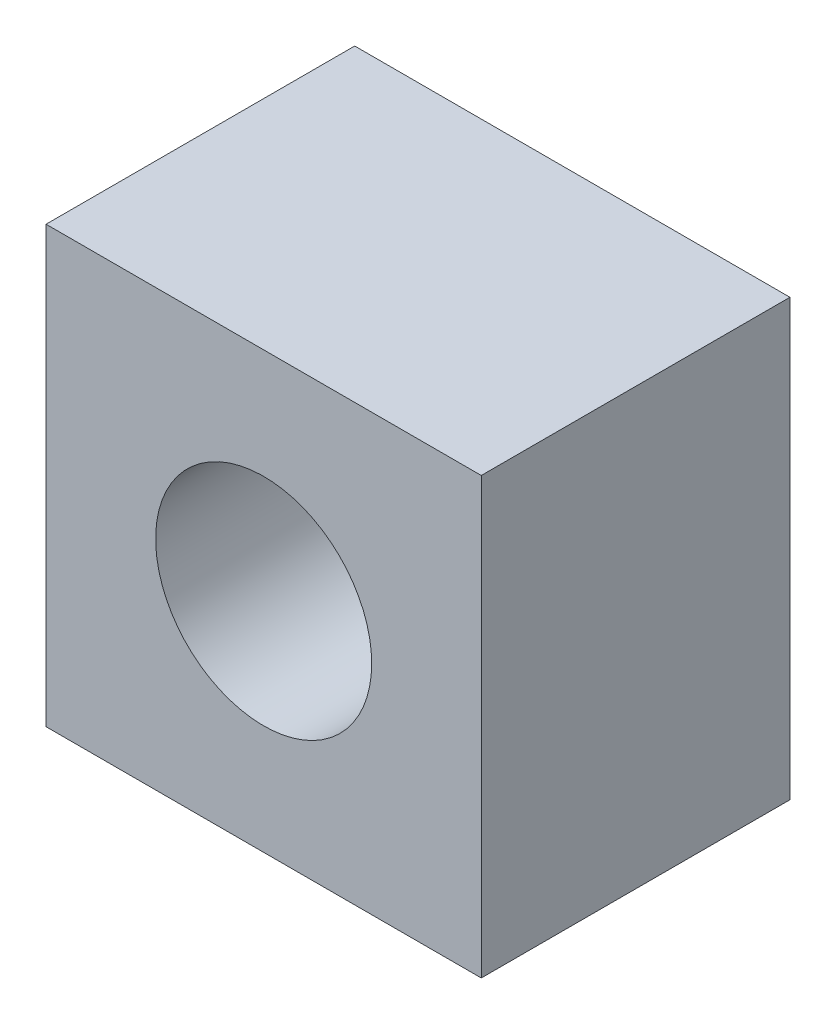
ISO-10303-21;
HEADER;
FILE_DESCRIPTION(('STEP AP214'),'2;1');
FILE_NAME('part.step','',(''),(''),'','','');
FILE_SCHEMA(('AUTOMOTIVE_DESIGN { 1 0 10303 214 1 1 1 1 }'));
ENDSEC;
DATA;
#1=APPLICATION_CONTEXT('core data for automotive mechanical design processes');
#2=APPLICATION_PROTOCOL_DEFINITION('international standard','automotive_design',2000,#1);
#3=PRODUCT_CONTEXT('',#1,'mechanical');
#4=PRODUCT('Part','Part','',(#3));
#5=PRODUCT_RELATED_PRODUCT_CATEGORY('part','',(#4));
#6=PRODUCT_DEFINITION_FORMATION('','',#4);
#7=PRODUCT_DEFINITION_CONTEXT('part definition',#1,'design');
#8=PRODUCT_DEFINITION('design','',#6,#7);
#9=PRODUCT_DEFINITION_SHAPE('','',#8);
#10=(LENGTH_UNIT() NAMED_UNIT(*) SI_UNIT(.MILLI.,.METRE.));
#11=(NAMED_UNIT(*) PLANE_ANGLE_UNIT() SI_UNIT($,.RADIAN.));
#12=(NAMED_UNIT(*) SI_UNIT($,.STERADIAN.) SOLID_ANGLE_UNIT());
#13=UNCERTAINTY_MEASURE_WITH_UNIT(LENGTH_MEASURE(1.E-05),#10,'distance_accuracy_value','');
#14=(GEOMETRIC_REPRESENTATION_CONTEXT(3) GLOBAL_UNCERTAINTY_ASSIGNED_CONTEXT((#13)) GLOBAL_UNIT_ASSIGNED_CONTEXT((#10,
#11,#12)) REPRESENTATION_CONTEXT('',''));
#15=CARTESIAN_POINT('',(0.,0.,0.));
#16=DIRECTION('',(0.,0.,1.));
#17=DIRECTION('',(1.,0.,0.));
#18=AXIS2_PLACEMENT_3D('',#15,#16,#17);
#19=CARTESIAN_POINT('',(-7.05,-7.05,10.));
#20=DIRECTION('',(0.,0.,1.));
#21=DIRECTION('',(1.,0.,0.));
#22=AXIS2_PLACEMENT_3D('',#19,#20,#21);
#23=PLANE('',#22);
#24=DIRECTION('',(0.,-1.,0.));
#25=VECTOR('',#24,1.);
#26=CARTESIAN_POINT('',(-7.05,7.05,10.));
#27=LINE('',#26,#25);
#28=CARTESIAN_POINT('',(-7.05,7.05,10.));
#29=VERTEX_POINT('',#28);
#30=CARTESIAN_POINT('',(-7.05,-7.05,10.));
#31=VERTEX_POINT('',#30);
#32=EDGE_CURVE('E99',#29,#31,#27,.T.);
#33=ORIENTED_EDGE('',*,*,#32,.T.);
#34=DIRECTION('',(1.,0.,0.));
#35=VECTOR('',#34,1.);
#36=CARTESIAN_POINT('',(-7.05,-7.05,10.));
#37=LINE('',#36,#35);
#38=CARTESIAN_POINT('',(7.05,-7.05,10.));
#39=VERTEX_POINT('',#38);
#40=EDGE_CURVE('E84',#31,#39,#37,.T.);
#41=ORIENTED_EDGE('',*,*,#40,.T.);
#42=DIRECTION('',(0.,1.,0.));
#43=VECTOR('',#42,1.);
#44=CARTESIAN_POINT('',(7.05,7.05,10.));
#45=LINE('',#44,#43);
#46=CARTESIAN_POINT('',(7.05,7.05,10.));
#47=VERTEX_POINT('',#46);
#48=EDGE_CURVE('E50',#39,#47,#45,.T.);
#49=ORIENTED_EDGE('',*,*,#48,.T.);
#50=DIRECTION('',(-1.,0.,0.));
#51=VECTOR('',#50,1.);
#52=CARTESIAN_POINT('',(-7.05,7.05,10.));
#53=LINE('',#52,#51);
#54=EDGE_CURVE('E45',#47,#29,#53,.T.);
#55=ORIENTED_EDGE('',*,*,#54,.T.);
#56=EDGE_LOOP('',(#33,#41,#49,#55));
#57=FACE_BOUND('',#56,.T.);
#58=CARTESIAN_POINT('',(0.,0.,10.));
#59=DIRECTION('',(0.,0.,1.));
#60=DIRECTION('',(1.,0.,0.));
#61=AXIS2_PLACEMENT_3D('',#58,#59,#60);
#62=CIRCLE('',#61,3.5);
#63=CARTESIAN_POINT('',(3.5,0.,10.));
#64=VERTEX_POINT('',#63);
#65=EDGE_CURVE('E89',#64,#64,#62,.T.);
#66=ORIENTED_EDGE('',*,*,#65,.F.);
#67=EDGE_LOOP('',(#66));
#68=FACE_BOUND('',#67,.T.);
#69=ADVANCED_FACE('F30',(#57,#68),#23,.T.);
#70=CARTESIAN_POINT('',(-7.05,-7.05,0.));
#71=DIRECTION('',(0.,0.,1.));
#72=DIRECTION('',(1.,0.,0.));
#73=AXIS2_PLACEMENT_3D('',#70,#71,#72);
#74=PLANE('',#73);
#75=DIRECTION('',(0.,-1.,0.));
#76=VECTOR('',#75,1.);
#77=CARTESIAN_POINT('',(-7.05,7.05,0.));
#78=LINE('',#77,#76);
#79=CARTESIAN_POINT('',(-7.05,7.05,0.));
#80=VERTEX_POINT('',#79);
#81=CARTESIAN_POINT('',(-7.05,-7.05,0.));
#82=VERTEX_POINT('',#81);
#83=EDGE_CURVE('E76',#80,#82,#78,.T.);
#84=ORIENTED_EDGE('',*,*,#83,.F.);
#85=DIRECTION('',(-1.,0.,0.));
#86=VECTOR('',#85,1.);
#87=CARTESIAN_POINT('',(-7.05,7.05,0.));
#88=LINE('',#87,#86);
#89=CARTESIAN_POINT('',(7.05,7.05,0.));
#90=VERTEX_POINT('',#89);
#91=EDGE_CURVE('E97',#90,#80,#88,.T.);
#92=ORIENTED_EDGE('',*,*,#91,.F.);
#93=DIRECTION('',(0.,1.,0.));
#94=VECTOR('',#93,1.);
#95=CARTESIAN_POINT('',(7.05,7.05,0.));
#96=LINE('',#95,#94);
#97=CARTESIAN_POINT('',(7.05,-7.05,0.));
#98=VERTEX_POINT('',#97);
#99=EDGE_CURVE('E77',#98,#90,#96,.T.);
#100=ORIENTED_EDGE('',*,*,#99,.F.);
#101=DIRECTION('',(1.,0.,0.));
#102=VECTOR('',#101,1.);
#103=CARTESIAN_POINT('',(-7.05,-7.05,0.));
#104=LINE('',#103,#102);
#105=EDGE_CURVE('E71',#82,#98,#104,.T.);
#106=ORIENTED_EDGE('',*,*,#105,.F.);
#107=EDGE_LOOP('',(#84,#92,#100,#106));
#108=FACE_BOUND('',#107,.T.);
#109=CARTESIAN_POINT('',(0.,0.,0.));
#110=DIRECTION('',(0.,0.,1.));
#111=DIRECTION('',(1.,0.,0.));
#112=AXIS2_PLACEMENT_3D('',#109,#110,#111);
#113=CIRCLE('',#112,3.5);
#114=CARTESIAN_POINT('',(3.5,0.,0.));
#115=VERTEX_POINT('',#114);
#116=EDGE_CURVE('E92',#115,#115,#113,.T.);
#117=ORIENTED_EDGE('',*,*,#116,.T.);
#118=EDGE_LOOP('',(#117));
#119=FACE_BOUND('',#118,.T.);
#120=ADVANCED_FACE('F72',(#108,#119),#74,.F.);
#121=CARTESIAN_POINT('',(-7.05,7.05,10.));
#122=DIRECTION('',(1.,0.,0.));
#123=DIRECTION('',(0.,1.,0.));
#124=AXIS2_PLACEMENT_3D('',#121,#122,#123);
#125=PLANE('',#124);
#126=ORIENTED_EDGE('',*,*,#83,.T.);
#127=DIRECTION('',(0.,0.,-1.));
#128=VECTOR('',#127,1.);
#129=CARTESIAN_POINT('',(-7.05,-7.05,10.));
#130=LINE('',#129,#128);
#131=EDGE_CURVE('E11',#31,#82,#130,.T.);
#132=ORIENTED_EDGE('',*,*,#131,.F.);
#133=ORIENTED_EDGE('',*,*,#32,.F.);
#134=DIRECTION('',(0.,0.,-1.));
#135=VECTOR('',#134,1.);
#136=CARTESIAN_POINT('',(-7.05,7.05,10.));
#137=LINE('',#136,#135);
#138=EDGE_CURVE('E88',#29,#80,#137,.T.);
#139=ORIENTED_EDGE('',*,*,#138,.T.);
#140=EDGE_LOOP('',(#126,#132,#133,#139));
#141=FACE_BOUND('',#140,.T.);
#142=ADVANCED_FACE('F32',(#141),#125,.F.);
#143=CARTESIAN_POINT('',(-7.05,-7.05,10.));
#144=DIRECTION('',(0.,1.,0.));
#145=DIRECTION('',(0.,0.,1.));
#146=AXIS2_PLACEMENT_3D('',#143,#144,#145);
#147=PLANE('',#146);
#148=ORIENTED_EDGE('',*,*,#105,.T.);
#149=DIRECTION('',(0.,0.,-1.));
#150=VECTOR('',#149,1.);
#151=CARTESIAN_POINT('',(7.05,-7.05,10.));
#152=LINE('',#151,#150);
#153=EDGE_CURVE('E38',#39,#98,#152,.T.);
#154=ORIENTED_EDGE('',*,*,#153,.F.);
#155=ORIENTED_EDGE('',*,*,#40,.F.);
#156=ORIENTED_EDGE('',*,*,#131,.T.);
#157=EDGE_LOOP('',(#148,#154,#155,#156));
#158=FACE_BOUND('',#157,.T.);
#159=ADVANCED_FACE('F83',(#158),#147,.F.);
#160=CARTESIAN_POINT('',(7.05,7.05,10.));
#161=DIRECTION('',(-1.,0.,0.));
#162=DIRECTION('',(0.,-1.,0.));
#163=AXIS2_PLACEMENT_3D('',#160,#161,#162);
#164=PLANE('',#163);
#165=ORIENTED_EDGE('',*,*,#99,.T.);
#166=DIRECTION('',(0.,0.,-1.));
#167=VECTOR('',#166,1.);
#168=CARTESIAN_POINT('',(7.05,7.05,10.));
#169=LINE('',#168,#167);
#170=EDGE_CURVE('E105',#47,#90,#169,.T.);
#171=ORIENTED_EDGE('',*,*,#170,.F.);
#172=ORIENTED_EDGE('',*,*,#48,.F.);
#173=ORIENTED_EDGE('',*,*,#153,.T.);
#174=EDGE_LOOP('',(#165,#171,#172,#173));
#175=FACE_BOUND('',#174,.T.);
#176=ADVANCED_FACE('F108',(#175),#164,.F.);
#177=CARTESIAN_POINT('',(-7.05,7.05,10.));
#178=DIRECTION('',(0.,-1.,0.));
#179=DIRECTION('',(1.,0.,0.));
#180=AXIS2_PLACEMENT_3D('',#177,#178,#179);
#181=PLANE('',#180);
#182=ORIENTED_EDGE('',*,*,#91,.T.);
#183=ORIENTED_EDGE('',*,*,#138,.F.);
#184=ORIENTED_EDGE('',*,*,#54,.F.);
#185=ORIENTED_EDGE('',*,*,#170,.T.);
#186=EDGE_LOOP('',(#182,#183,#184,#185));
#187=FACE_BOUND('',#186,.T.);
#188=ADVANCED_FACE('F110',(#187),#181,.F.);
#189=CARTESIAN_POINT('',(0.,0.,10.));
#190=DIRECTION('',(0.,0.,-1.));
#191=DIRECTION('',(-1.,0.,0.));
#192=AXIS2_PLACEMENT_3D('',#189,#190,#191);
#193=CYLINDRICAL_SURFACE('',#192,3.5);
#194=ORIENTED_EDGE('',*,*,#65,.T.);
#195=EDGE_LOOP('',(#194));
#196=FACE_BOUND('',#195,.T.);
#197=ORIENTED_EDGE('',*,*,#116,.F.);
#198=EDGE_LOOP('',(#197));
#199=FACE_BOUND('',#198,.T.);
#200=ADVANCED_FACE('F116',(#196,#199),#193,.F.);
#201=CLOSED_SHELL('',(#69,#120,#142,#159,#176,#188,#200));
#202=MANIFOLD_SOLID_BREP('B2',#201);
#203=ADVANCED_BREP_SHAPE_REPRESENTATION('',(#18,#202),#14);
#204=SHAPE_DEFINITION_REPRESENTATION(#9,#203);
ENDSEC;
END-ISO-10303-21;
